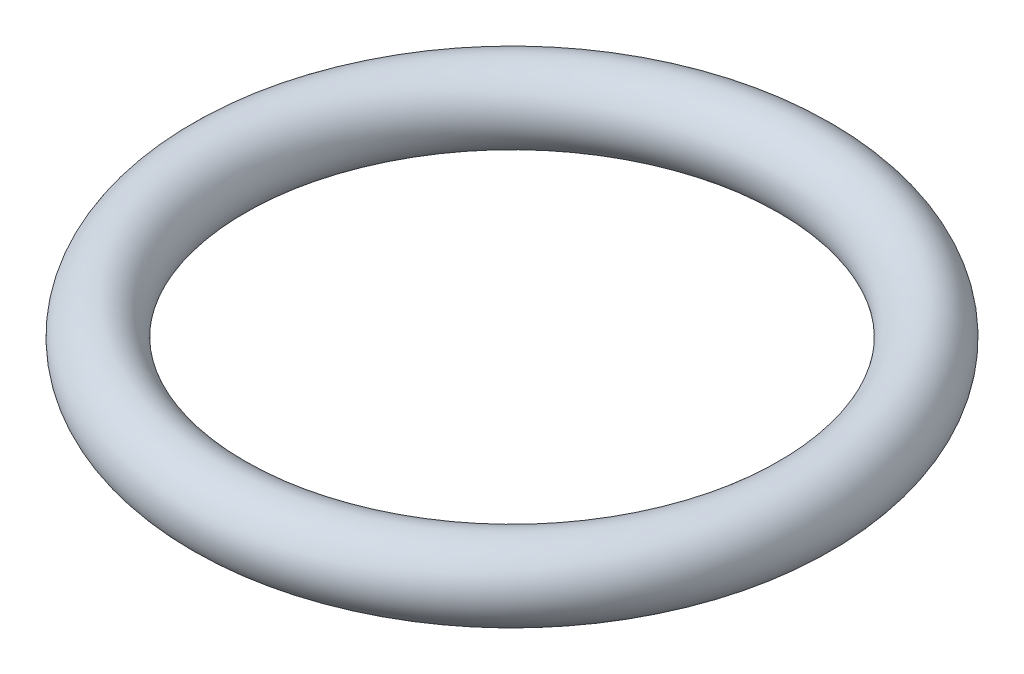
from build123d import *

# Parameters (mm, degrees)
SKETCH2_R = 0.889


with BuildPart() as part:
    # Sweep1: sweep along a path in Sketch1
    with BuildLine(Plane(origin=(0, 0, 0), x_dir=(1, 0, 0), z_dir=(0, 1, 0))) as sweep1_path:
        CenterArc((0, 0), 6.2103, 0, 360)
    # Sketch2 → Sweep1 (sweep)
    with BuildSketch(Plane.XY):
        with Locations((-7.0993, 0)):
            Circle(SKETCH2_R)
    sweep(path=sweep1_path.line)


solid = part.part
